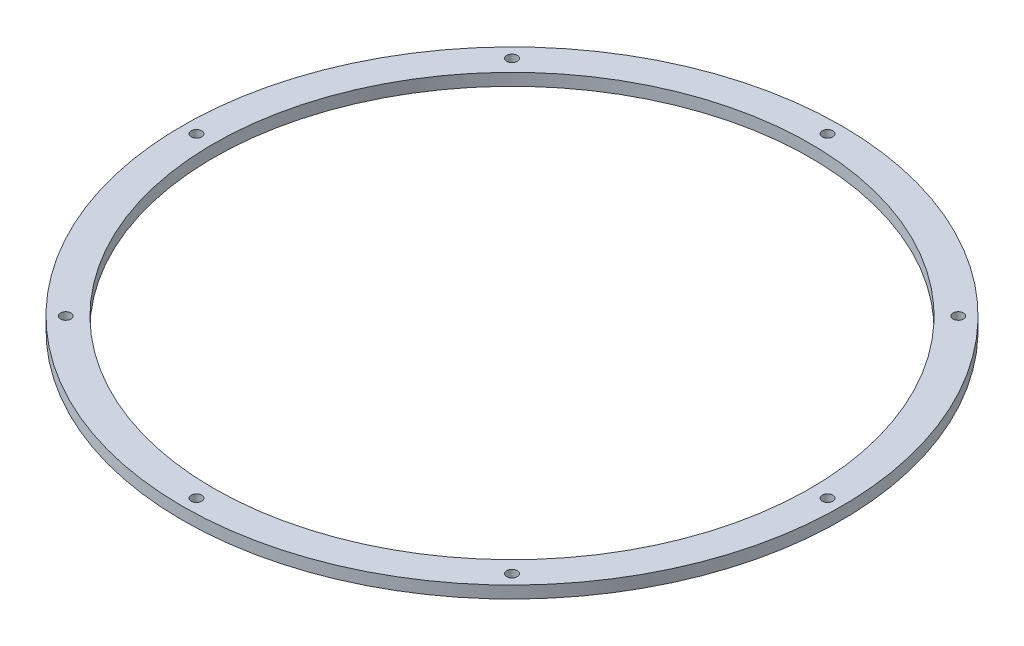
from build123d import *

# Parameters (mm, degrees)
SKETCH1_R            = 134.62
SKETCH1_R_2          = 121.92
BOSS_EXTRUDE1_DEPTH  = 4.953
M4_CLEARANCE_HOLE1_D = 4.3
CIRPATTERN1_COUNT    = 8


with BuildPart() as part:
    # Sketch1 → Boss-Extrude1 (new body)
    with BuildSketch(Plane(origin=(0, 0, 0), x_dir=(1, 0, 0), z_dir=(0, 1, 0))):
        with Locations(Location((0, 0, 0), (0, 0, 270))):
            Circle(SKETCH1_R)
        with Locations(Location((0, 0, 0), (0, 0, 270))):
            Circle(SKETCH1_R_2, mode=Mode.SUBTRACT)
    extrude(amount=BOSS_EXTRUDE1_DEPTH)

    # M4 Clearance Hole1 (through all)
    with Locations(Plane(origin=(0, 4.953, 0), x_dir=(1, 0, 0), z_dir=(0, 1, 0))):
        with Locations((0, 128.905)):
            m4_clearance_hole1 = Hole(M4_CLEARANCE_HOLE1_D / 2)

    # CirPattern1: M4 Clearance Hole1 ×8 about axis
    cirpattern1_axis = Axis((0, 0, 0), (0, 1, 0))
    for i in range(1, CIRPATTERN1_COUNT):
        add(m4_clearance_hole1.rotate(cirpattern1_axis, i * 360 / CIRPATTERN1_COUNT), mode=Mode.SUBTRACT)


solid = part.part
